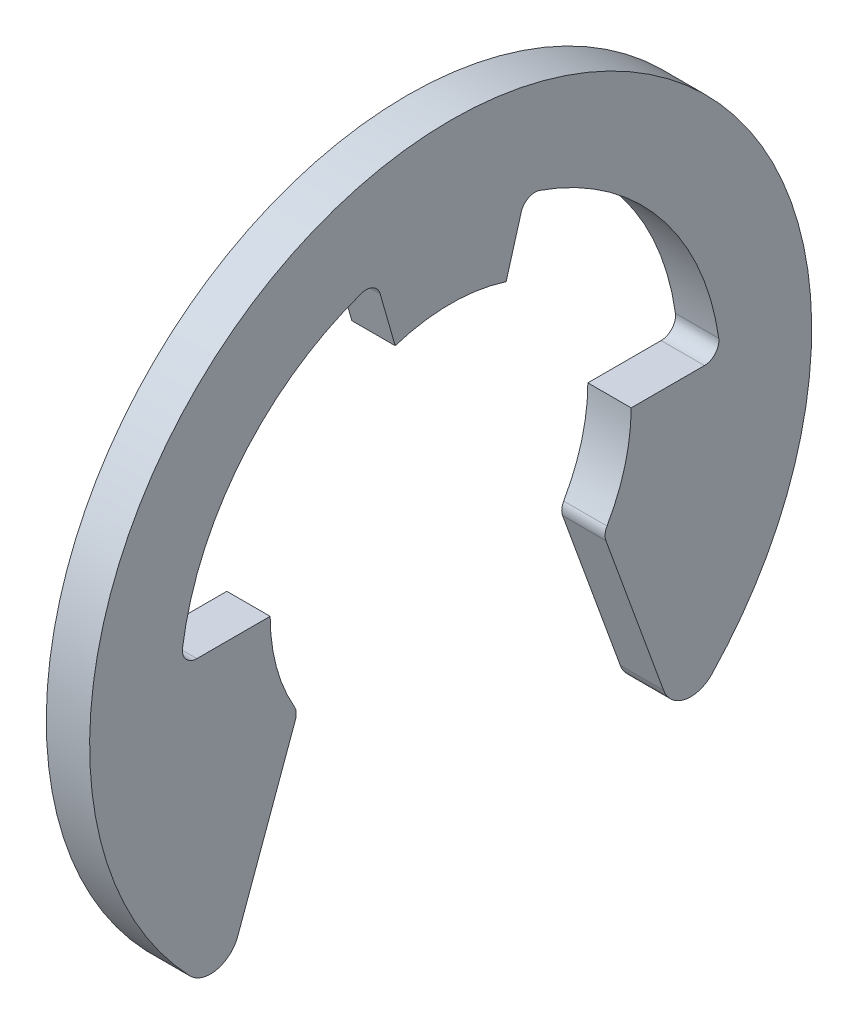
ISO-10303-21;
HEADER;
FILE_DESCRIPTION(('STEP AP214'),'2;1');
FILE_NAME('part.step','',(''),(''),'','','');
FILE_SCHEMA(('AUTOMOTIVE_DESIGN { 1 0 10303 214 1 1 1 1 }'));
ENDSEC;
DATA;
#1=APPLICATION_CONTEXT('core data for automotive mechanical design processes');
#2=APPLICATION_PROTOCOL_DEFINITION('international standard','automotive_design',2000,#1);
#3=PRODUCT_CONTEXT('',#1,'mechanical');
#4=PRODUCT('Part','Part','',(#3));
#5=PRODUCT_RELATED_PRODUCT_CATEGORY('part','',(#4));
#6=PRODUCT_DEFINITION_FORMATION('','',#4);
#7=PRODUCT_DEFINITION_CONTEXT('part definition',#1,'design');
#8=PRODUCT_DEFINITION('design','',#6,#7);
#9=PRODUCT_DEFINITION_SHAPE('','',#8);
#10=(LENGTH_UNIT() NAMED_UNIT(*) SI_UNIT(.MILLI.,.METRE.));
#11=(NAMED_UNIT(*) PLANE_ANGLE_UNIT() SI_UNIT($,.RADIAN.));
#12=(NAMED_UNIT(*) SI_UNIT($,.STERADIAN.) SOLID_ANGLE_UNIT());
#13=UNCERTAINTY_MEASURE_WITH_UNIT(LENGTH_MEASURE(1.E-05),#10,'distance_accuracy_value','');
#14=(GEOMETRIC_REPRESENTATION_CONTEXT(3) GLOBAL_UNCERTAINTY_ASSIGNED_CONTEXT((#13)) GLOBAL_UNIT_ASSIGNED_CONTEXT((#10,
#11,#12)) REPRESENTATION_CONTEXT('',''));
#15=CARTESIAN_POINT('',(0.,0.,0.));
#16=DIRECTION('',(0.,0.,1.));
#17=DIRECTION('',(1.,0.,0.));
#18=AXIS2_PLACEMENT_3D('',#15,#16,#17);
#19=CARTESIAN_POINT('',(1.2,1.,-7.02922470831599));
#20=DIRECTION('',(-1.,0.,0.));
#21=DIRECTION('',(0.,0.,1.));
#22=AXIS2_PLACEMENT_3D('',#19,#20,#21);
#23=CYLINDRICAL_SURFACE('',#22,0.399999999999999);
#24=CARTESIAN_POINT('',(0.,1.,-7.02922470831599));
#25=DIRECTION('',(-1.,0.,0.));
#26=DIRECTION('',(0.,0.,1.));
#27=AXIS2_PLACEMENT_3D('',#24,#25,#26);
#28=CIRCLE('',#27,0.399999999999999);
#29=CARTESIAN_POINT('',(0.,1.05633802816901,-7.42523736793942));
#30=VERTEX_POINT('',#29);
#31=CARTESIAN_POINT('',(0.,0.6,-7.02922470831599));
#32=VERTEX_POINT('',#31);
#33=EDGE_CURVE('E181',#30,#32,#28,.T.);
#34=ORIENTED_EDGE('',*,*,#33,.T.);
#35=DIRECTION('',(-1.,0.,0.));
#36=VECTOR('',#35,1.);
#37=CARTESIAN_POINT('',(1.2,0.6,-7.02922470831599));
#38=LINE('',#37,#36);
#39=CARTESIAN_POINT('',(1.2,0.6,-7.02922470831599));
#40=VERTEX_POINT('',#39);
#41=EDGE_CURVE('E11',#40,#32,#38,.T.);
#42=ORIENTED_EDGE('',*,*,#41,.F.);
#43=CARTESIAN_POINT('',(1.2,1.,-7.02922470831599));
#44=DIRECTION('',(-1.,0.,0.));
#45=DIRECTION('',(0.,0.,1.));
#46=AXIS2_PLACEMENT_3D('',#43,#44,#45);
#47=CIRCLE('',#46,0.399999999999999);
#48=CARTESIAN_POINT('',(1.2,1.05633802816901,-7.42523736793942));
#49=VERTEX_POINT('',#48);
#50=EDGE_CURVE('E240',#49,#40,#47,.T.);
#51=ORIENTED_EDGE('',*,*,#50,.F.);
#52=DIRECTION('',(-1.,0.,0.));
#53=VECTOR('',#52,1.);
#54=CARTESIAN_POINT('',(1.2,1.05633802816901,-7.42523736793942));
#55=LINE('',#54,#53);
#56=EDGE_CURVE('E49',#49,#30,#55,.T.);
#57=ORIENTED_EDGE('',*,*,#56,.T.);
#58=EDGE_LOOP('',(#34,#42,#51,#57));
#59=FACE_BOUND('',#58,.T.);
#60=ADVANCED_FACE('F35',(#59),#23,.F.);
#61=CARTESIAN_POINT('',(1.2,0.6,-5.));
#62=DIRECTION('',(0.,1.,0.));
#63=DIRECTION('',(0.,0.,1.));
#64=AXIS2_PLACEMENT_3D('',#61,#62,#63);
#65=PLANE('',#64);
#66=DIRECTION('',(0.,0.,-1.));
#67=VECTOR('',#66,1.);
#68=CARTESIAN_POINT('',(0.,0.6,-5.));
#69=LINE('',#68,#67);
#70=CARTESIAN_POINT('',(0.,0.600000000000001,-5.));
#71=VERTEX_POINT('',#70);
#72=EDGE_CURVE('E176',#71,#32,#69,.T.);
#73=ORIENTED_EDGE('',*,*,#72,.F.);
#74=DIRECTION('',(-1.,0.,0.));
#75=VECTOR('',#74,1.);
#76=CARTESIAN_POINT('',(1.2,0.600000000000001,-5.));
#77=LINE('',#76,#75);
#78=CARTESIAN_POINT('',(1.2,0.600000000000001,-5.));
#79=VERTEX_POINT('',#78);
#80=EDGE_CURVE('E42',#79,#71,#77,.T.);
#81=ORIENTED_EDGE('',*,*,#80,.F.);
#82=DIRECTION('',(0.,0.,-1.));
#83=VECTOR('',#82,1.);
#84=CARTESIAN_POINT('',(1.2,0.6,-5.));
#85=LINE('',#84,#83);
#86=EDGE_CURVE('E178',#79,#40,#85,.T.);
#87=ORIENTED_EDGE('',*,*,#86,.T.);
#88=ORIENTED_EDGE('',*,*,#41,.T.);
#89=EDGE_LOOP('',(#73,#81,#87,#88));
#90=FACE_BOUND('',#89,.T.);
#91=ADVANCED_FACE('F174',(#90),#65,.T.);
#92=CARTESIAN_POINT('',(1.2,0.6,0.));
#93=DIRECTION('',(-1.,0.,0.));
#94=DIRECTION('',(0.,0.,1.));
#95=AXIS2_PLACEMENT_3D('',#92,#93,#94);
#96=CYLINDRICAL_SURFACE('',#95,5.);
#97=CARTESIAN_POINT('',(0.,0.6,0.));
#98=DIRECTION('',(-1.,0.,0.));
#99=DIRECTION('',(0.,0.,1.));
#100=AXIS2_PLACEMENT_3D('',#97,#98,#99);
#101=CIRCLE('',#100,5.);
#102=CARTESIAN_POINT('',(0.,-1.89993484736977,-4.33016463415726));
#103=VERTEX_POINT('',#102);
#104=EDGE_CURVE('E189',#71,#103,#101,.T.);
#105=ORIENTED_EDGE('',*,*,#104,.T.);
#106=DIRECTION('',(-1.,0.,0.));
#107=VECTOR('',#106,1.);
#108=CARTESIAN_POINT('',(1.2,-1.89993484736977,-4.33016463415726));
#109=LINE('',#108,#107);
#110=CARTESIAN_POINT('',(1.2,-1.89993484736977,-4.33016463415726));
#111=VERTEX_POINT('',#110);
#112=EDGE_CURVE('E320',#111,#103,#109,.T.);
#113=ORIENTED_EDGE('',*,*,#112,.F.);
#114=CARTESIAN_POINT('',(1.2,0.6,0.));
#115=DIRECTION('',(-1.,0.,0.));
#116=DIRECTION('',(0.,0.,1.));
#117=AXIS2_PLACEMENT_3D('',#114,#115,#116);
#118=CIRCLE('',#117,5.);
#119=EDGE_CURVE('E243',#79,#111,#118,.T.);
#120=ORIENTED_EDGE('',*,*,#119,.F.);
#121=ORIENTED_EDGE('',*,*,#80,.T.);
#122=EDGE_LOOP('',(#105,#113,#120,#121));
#123=FACE_BOUND('',#122,.T.);
#124=ADVANCED_FACE('F323',(#123),#96,.F.);
#125=CARTESIAN_POINT('',(1.2,-2.09992963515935,-4.67657780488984));
#126=DIRECTION('',(-1.,0.,0.));
#127=DIRECTION('',(0.,0.,1.));
#128=AXIS2_PLACEMENT_3D('',#125,#126,#127);
#129=CYLINDRICAL_SURFACE('',#128,0.4);
#130=CARTESIAN_POINT('',(0.,-2.09992963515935,-4.67657780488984));
#131=DIRECTION('',(-1.,0.,0.));
#132=DIRECTION('',(0.,0.,1.));
#133=AXIS2_PLACEMENT_3D('',#130,#131,#132);
#134=CIRCLE('',#133,0.4);
#135=CARTESIAN_POINT('',(0.,-2.23673769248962,-4.30070075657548));
#136=VERTEX_POINT('',#135);
#137=EDGE_CURVE('E191',#136,#103,#134,.T.);
#138=ORIENTED_EDGE('',*,*,#137,.F.);
#139=DIRECTION('',(-1.,0.,0.));
#140=VECTOR('',#139,1.);
#141=CARTESIAN_POINT('',(1.2,-2.23673769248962,-4.30070075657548));
#142=LINE('',#141,#140);
#143=CARTESIAN_POINT('',(1.2,-2.23673769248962,-4.30070075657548));
#144=VERTEX_POINT('',#143);
#145=EDGE_CURVE('E318',#144,#136,#142,.T.);
#146=ORIENTED_EDGE('',*,*,#145,.F.);
#147=CARTESIAN_POINT('',(1.2,-2.09992963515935,-4.67657780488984));
#148=DIRECTION('',(-1.,0.,0.));
#149=DIRECTION('',(0.,0.,1.));
#150=AXIS2_PLACEMENT_3D('',#147,#148,#149);
#151=CIRCLE('',#150,0.4);
#152=EDGE_CURVE('E245',#144,#111,#151,.T.);
#153=ORIENTED_EDGE('',*,*,#152,.T.);
#154=ORIENTED_EDGE('',*,*,#112,.T.);
#155=EDGE_LOOP('',(#138,#146,#153,#154));
#156=FACE_BOUND('',#155,.T.);
#157=ADVANCED_FACE('F394',(#156),#129,.T.);
#158=CARTESIAN_POINT('',(1.2,-2.23673769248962,-4.30070075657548));
#159=DIRECTION('',(0.,0.34202014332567,-0.939692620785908));
#160=DIRECTION('',(0.,0.939692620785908,0.34202014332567));
#161=AXIS2_PLACEMENT_3D('',#158,#159,#160);
#162=PLANE('',#161);
#163=DIRECTION('',(0.,-0.939692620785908,-0.34202014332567));
#164=VECTOR('',#163,1.);
#165=CARTESIAN_POINT('',(0.,-2.23673769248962,-4.30070075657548));
#166=LINE('',#165,#164);
#167=CARTESIAN_POINT('',(0.,-6.62967585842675,-5.89959948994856));
#168=VERTEX_POINT('',#167);
#169=EDGE_CURVE('E195',#136,#168,#166,.T.);
#170=ORIENTED_EDGE('',*,*,#169,.T.);
#171=DIRECTION('',(-1.,0.,0.));
#172=VECTOR('',#171,1.);
#173=CARTESIAN_POINT('',(1.2,-6.62967585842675,-5.89959948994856));
#174=LINE('',#173,#172);
#175=CARTESIAN_POINT('',(1.2,-6.62967585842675,-5.89959948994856));
#176=VERTEX_POINT('',#175);
#177=EDGE_CURVE('E316',#176,#168,#174,.T.);
#178=ORIENTED_EDGE('',*,*,#177,.F.);
#179=DIRECTION('',(0.,-0.939692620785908,-0.34202014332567));
#180=VECTOR('',#179,1.);
#181=CARTESIAN_POINT('',(1.2,-2.23673769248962,-4.30070075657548));
#182=LINE('',#181,#180);
#183=EDGE_CURVE('E248',#144,#176,#182,.T.);
#184=ORIENTED_EDGE('',*,*,#183,.F.);
#185=ORIENTED_EDGE('',*,*,#145,.T.);
#186=EDGE_LOOP('',(#170,#178,#184,#185));
#187=FACE_BOUND('',#186,.T.);
#188=ADVANCED_FACE('F391',(#187),#162,.F.);
#189=CARTESIAN_POINT('',(1.2,-6.35605974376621,-6.65135358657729));
#190=DIRECTION('',(-1.,0.,0.));
#191=DIRECTION('',(0.,0.,1.));
#192=AXIS2_PLACEMENT_3D('',#189,#190,#191);
#193=CYLINDRICAL_SURFACE('',#192,0.8);
#194=CARTESIAN_POINT('',(0.,-6.35605974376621,-6.65135358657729));
#195=DIRECTION('',(-1.,0.,0.));
#196=DIRECTION('',(0.,0.,1.));
#197=AXIS2_PLACEMENT_3D('',#194,#195,#196);
#198=CIRCLE('',#197,0.8);
#199=CARTESIAN_POINT('',(0.,-6.90876059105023,-7.22973215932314));
#200=VERTEX_POINT('',#199);
#201=EDGE_CURVE('E198',#200,#168,#198,.T.);
#202=ORIENTED_EDGE('',*,*,#201,.F.);
#203=DIRECTION('',(-1.,0.,0.));
#204=VECTOR('',#203,1.);
#205=CARTESIAN_POINT('',(1.2,-6.90876059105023,-7.22973215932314));
#206=LINE('',#205,#204);
#207=CARTESIAN_POINT('',(1.2,-6.90876059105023,-7.22973215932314));
#208=VERTEX_POINT('',#207);
#209=EDGE_CURVE('E314',#208,#200,#206,.T.);
#210=ORIENTED_EDGE('',*,*,#209,.F.);
#211=CARTESIAN_POINT('',(1.2,-6.35605974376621,-6.65135358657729));
#212=DIRECTION('',(-1.,0.,0.));
#213=DIRECTION('',(0.,0.,1.));
#214=AXIS2_PLACEMENT_3D('',#211,#212,#213);
#215=CIRCLE('',#214,0.8);
#216=EDGE_CURVE('E250',#208,#176,#215,.T.);
#217=ORIENTED_EDGE('',*,*,#216,.T.);
#218=ORIENTED_EDGE('',*,*,#177,.T.);
#219=EDGE_LOOP('',(#202,#210,#217,#218));
#220=FACE_BOUND('',#219,.T.);
#221=ADVANCED_FACE('F385',(#220),#193,.T.);
#222=CARTESIAN_POINT('',(1.2,0.,0.));
#223=DIRECTION('',(-1.,0.,0.));
#224=DIRECTION('',(0.,0.,1.));
#225=AXIS2_PLACEMENT_3D('',#222,#223,#224);
#226=CYLINDRICAL_SURFACE('',#225,10.);
#227=CARTESIAN_POINT('',(0.,0.,0.));
#228=DIRECTION('',(1.,0.,0.));
#229=DIRECTION('',(0.,0.,-1.));
#230=AXIS2_PLACEMENT_3D('',#227,#228,#229);
#231=CIRCLE('',#230,10.);
#232=CARTESIAN_POINT('',(0.,-6.90876059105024,7.22973215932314));
#233=VERTEX_POINT('',#232);
#234=EDGE_CURVE('E201',#200,#233,#231,.T.);
#235=ORIENTED_EDGE('',*,*,#234,.T.);
#236=DIRECTION('',(-1.,0.,0.));
#237=VECTOR('',#236,1.);
#238=CARTESIAN_POINT('',(1.2,-6.90876059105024,7.22973215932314));
#239=LINE('',#238,#237);
#240=CARTESIAN_POINT('',(1.2,-6.90876059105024,7.22973215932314));
#241=VERTEX_POINT('',#240);
#242=EDGE_CURVE('E311',#241,#233,#239,.T.);
#243=ORIENTED_EDGE('',*,*,#242,.F.);
#244=CARTESIAN_POINT('',(1.2,0.,0.));
#245=DIRECTION('',(1.,0.,0.));
#246=DIRECTION('',(0.,0.,-1.));
#247=AXIS2_PLACEMENT_3D('',#244,#245,#246);
#248=CIRCLE('',#247,10.);
#249=EDGE_CURVE('E253',#208,#241,#248,.T.);
#250=ORIENTED_EDGE('',*,*,#249,.F.);
#251=ORIENTED_EDGE('',*,*,#209,.T.);
#252=EDGE_LOOP('',(#235,#243,#250,#251));
#253=FACE_BOUND('',#252,.T.);
#254=ADVANCED_FACE('F395',(#253),#226,.T.);
#255=CARTESIAN_POINT('',(1.2,-6.35605974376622,6.65135358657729));
#256=DIRECTION('',(-1.,0.,0.));
#257=DIRECTION('',(0.,0.,1.));
#258=AXIS2_PLACEMENT_3D('',#255,#256,#257);
#259=CYLINDRICAL_SURFACE('',#258,0.8);
#260=CARTESIAN_POINT('',(0.,-6.35605974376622,6.65135358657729));
#261=DIRECTION('',(1.,0.,0.));
#262=DIRECTION('',(0.,0.,-1.));
#263=AXIS2_PLACEMENT_3D('',#260,#261,#262);
#264=CIRCLE('',#263,0.8);
#265=CARTESIAN_POINT('',(0.,-6.62967585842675,5.89959948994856));
#266=VERTEX_POINT('',#265);
#267=EDGE_CURVE('E203',#233,#266,#264,.T.);
#268=ORIENTED_EDGE('',*,*,#267,.T.);
#269=DIRECTION('',(-1.,0.,0.));
#270=VECTOR('',#269,1.);
#271=CARTESIAN_POINT('',(1.2,-6.62967585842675,5.89959948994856));
#272=LINE('',#271,#270);
#273=CARTESIAN_POINT('',(1.2,-6.62967585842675,5.89959948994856));
#274=VERTEX_POINT('',#273);
#275=EDGE_CURVE('E309',#274,#266,#272,.T.);
#276=ORIENTED_EDGE('',*,*,#275,.F.);
#277=CARTESIAN_POINT('',(1.2,-6.35605974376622,6.65135358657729));
#278=DIRECTION('',(1.,0.,0.));
#279=DIRECTION('',(0.,0.,-1.));
#280=AXIS2_PLACEMENT_3D('',#277,#278,#279);
#281=CIRCLE('',#280,0.8);
#282=EDGE_CURVE('E255',#241,#274,#281,.T.);
#283=ORIENTED_EDGE('',*,*,#282,.F.);
#284=ORIENTED_EDGE('',*,*,#242,.T.);
#285=EDGE_LOOP('',(#268,#276,#283,#284));
#286=FACE_BOUND('',#285,.T.);
#287=ADVANCED_FACE('F378',(#286),#259,.T.);
#288=CARTESIAN_POINT('',(1.2,-2.23673769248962,4.30070075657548));
#289=DIRECTION('',(0.,-0.34202014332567,-0.939692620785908));
#290=DIRECTION('',(0.,0.939692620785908,-0.34202014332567));
#291=AXIS2_PLACEMENT_3D('',#288,#289,#290);
#292=PLANE('',#291);
#293=DIRECTION('',(0.,-0.939692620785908,0.34202014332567));
#294=VECTOR('',#293,1.);
#295=CARTESIAN_POINT('',(0.,-2.23673769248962,4.30070075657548));
#296=LINE('',#295,#294);
#297=CARTESIAN_POINT('',(0.,-2.23673769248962,4.30070075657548));
#298=VERTEX_POINT('',#297);
#299=EDGE_CURVE('E206',#298,#266,#296,.T.);
#300=ORIENTED_EDGE('',*,*,#299,.F.);
#301=DIRECTION('',(-1.,0.,0.));
#302=VECTOR('',#301,1.);
#303=CARTESIAN_POINT('',(1.2,-2.23673769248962,4.30070075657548));
#304=LINE('',#303,#302);
#305=CARTESIAN_POINT('',(1.2,-2.23673769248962,4.30070075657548));
#306=VERTEX_POINT('',#305);
#307=EDGE_CURVE('E307',#306,#298,#304,.T.);
#308=ORIENTED_EDGE('',*,*,#307,.F.);
#309=DIRECTION('',(0.,-0.939692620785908,0.34202014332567));
#310=VECTOR('',#309,1.);
#311=CARTESIAN_POINT('',(1.2,-2.23673769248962,4.30070075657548));
#312=LINE('',#311,#310);
#313=EDGE_CURVE('E257',#306,#274,#312,.T.);
#314=ORIENTED_EDGE('',*,*,#313,.T.);
#315=ORIENTED_EDGE('',*,*,#275,.T.);
#316=EDGE_LOOP('',(#300,#308,#314,#315));
#317=FACE_BOUND('',#316,.T.);
#318=ADVANCED_FACE('F373',(#317),#292,.T.);
#319=CARTESIAN_POINT('',(1.2,-2.09992963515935,4.67657780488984));
#320=DIRECTION('',(-1.,0.,0.));
#321=DIRECTION('',(0.,0.,1.));
#322=AXIS2_PLACEMENT_3D('',#319,#320,#321);
#323=CYLINDRICAL_SURFACE('',#322,0.4);
#324=CARTESIAN_POINT('',(0.,-2.09992963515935,4.67657780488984));
#325=DIRECTION('',(1.,0.,0.));
#326=DIRECTION('',(0.,0.,-1.));
#327=AXIS2_PLACEMENT_3D('',#324,#325,#326);
#328=CIRCLE('',#327,0.4);
#329=CARTESIAN_POINT('',(0.,-1.89993484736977,4.33016463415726));
#330=VERTEX_POINT('',#329);
#331=EDGE_CURVE('E209',#298,#330,#328,.T.);
#332=ORIENTED_EDGE('',*,*,#331,.T.);
#333=DIRECTION('',(-1.,0.,0.));
#334=VECTOR('',#333,1.);
#335=CARTESIAN_POINT('',(1.2,-1.89993484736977,4.33016463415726));
#336=LINE('',#335,#334);
#337=CARTESIAN_POINT('',(1.2,-1.89993484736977,4.33016463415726));
#338=VERTEX_POINT('',#337);
#339=EDGE_CURVE('E305',#338,#330,#336,.T.);
#340=ORIENTED_EDGE('',*,*,#339,.F.);
#341=CARTESIAN_POINT('',(1.2,-2.09992963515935,4.67657780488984));
#342=DIRECTION('',(1.,0.,0.));
#343=DIRECTION('',(0.,0.,-1.));
#344=AXIS2_PLACEMENT_3D('',#341,#342,#343);
#345=CIRCLE('',#344,0.4);
#346=EDGE_CURVE('E260',#306,#338,#345,.T.);
#347=ORIENTED_EDGE('',*,*,#346,.F.);
#348=ORIENTED_EDGE('',*,*,#307,.T.);
#349=EDGE_LOOP('',(#332,#340,#347,#348));
#350=FACE_BOUND('',#349,.T.);
#351=ADVANCED_FACE('F369',(#350),#323,.T.);
#352=CARTESIAN_POINT('',(1.2,0.6,0.));
#353=DIRECTION('',(-1.,0.,0.));
#354=DIRECTION('',(0.,0.,1.));
#355=AXIS2_PLACEMENT_3D('',#352,#353,#354);
#356=CYLINDRICAL_SURFACE('',#355,5.);
#357=CARTESIAN_POINT('',(0.,0.6,0.));
#358=DIRECTION('',(1.,0.,0.));
#359=DIRECTION('',(0.,0.,-1.));
#360=AXIS2_PLACEMENT_3D('',#357,#358,#359);
#361=CIRCLE('',#360,5.);
#362=CARTESIAN_POINT('',(0.,0.599999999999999,5.));
#363=VERTEX_POINT('',#362);
#364=EDGE_CURVE('E212',#363,#330,#361,.T.);
#365=ORIENTED_EDGE('',*,*,#364,.F.);
#366=DIRECTION('',(-1.,0.,0.));
#367=VECTOR('',#366,1.);
#368=CARTESIAN_POINT('',(1.2,0.599999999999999,5.));
#369=LINE('',#368,#367);
#370=CARTESIAN_POINT('',(1.2,0.599999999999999,5.));
#371=VERTEX_POINT('',#370);
#372=EDGE_CURVE('E303',#371,#363,#369,.T.);
#373=ORIENTED_EDGE('',*,*,#372,.F.);
#374=CARTESIAN_POINT('',(1.2,0.6,0.));
#375=DIRECTION('',(1.,0.,0.));
#376=DIRECTION('',(0.,0.,-1.));
#377=AXIS2_PLACEMENT_3D('',#374,#375,#376);
#378=CIRCLE('',#377,5.);
#379=EDGE_CURVE('E262',#371,#338,#378,.T.);
#380=ORIENTED_EDGE('',*,*,#379,.T.);
#381=ORIENTED_EDGE('',*,*,#339,.T.);
#382=EDGE_LOOP('',(#365,#373,#380,#381));
#383=FACE_BOUND('',#382,.T.);
#384=ADVANCED_FACE('F363',(#383),#356,.F.);
#385=CARTESIAN_POINT('',(1.2,0.599999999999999,5.));
#386=DIRECTION('',(0.,-1.,0.));
#387=DIRECTION('',(0.,0.,-1.));
#388=AXIS2_PLACEMENT_3D('',#385,#386,#387);
#389=PLANE('',#388);
#390=DIRECTION('',(0.,0.,1.));
#391=VECTOR('',#390,1.);
#392=CARTESIAN_POINT('',(0.,0.599999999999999,5.));
#393=LINE('',#392,#391);
#394=CARTESIAN_POINT('',(0.,0.599999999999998,7.02922470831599));
#395=VERTEX_POINT('',#394);
#396=EDGE_CURVE('E215',#363,#395,#393,.T.);
#397=ORIENTED_EDGE('',*,*,#396,.T.);
#398=DIRECTION('',(-1.,0.,0.));
#399=VECTOR('',#398,1.);
#400=CARTESIAN_POINT('',(1.2,0.599999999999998,7.02922470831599));
#401=LINE('',#400,#399);
#402=CARTESIAN_POINT('',(1.2,0.599999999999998,7.02922470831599));
#403=VERTEX_POINT('',#402);
#404=EDGE_CURVE('E301',#403,#395,#401,.T.);
#405=ORIENTED_EDGE('',*,*,#404,.F.);
#406=DIRECTION('',(0.,0.,1.));
#407=VECTOR('',#406,1.);
#408=CARTESIAN_POINT('',(1.2,0.599999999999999,5.));
#409=LINE('',#408,#407);
#410=EDGE_CURVE('E265',#371,#403,#409,.T.);
#411=ORIENTED_EDGE('',*,*,#410,.F.);
#412=ORIENTED_EDGE('',*,*,#372,.T.);
#413=EDGE_LOOP('',(#397,#405,#411,#412));
#414=FACE_BOUND('',#413,.T.);
#415=ADVANCED_FACE('F459',(#414),#389,.F.);
#416=CARTESIAN_POINT('',(1.2,0.999999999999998,7.02922470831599));
#417=DIRECTION('',(-1.,0.,0.));
#418=DIRECTION('',(0.,0.,1.));
#419=AXIS2_PLACEMENT_3D('',#416,#417,#418);
#420=CYLINDRICAL_SURFACE('',#419,0.399999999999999);
#421=CARTESIAN_POINT('',(0.,0.999999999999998,7.02922470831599));
#422=DIRECTION('',(1.,0.,0.));
#423=DIRECTION('',(0.,0.,-1.));
#424=AXIS2_PLACEMENT_3D('',#421,#422,#423);
#425=CIRCLE('',#424,0.399999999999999);
#426=CARTESIAN_POINT('',(0.,1.05633802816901,7.42523736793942));
#427=VERTEX_POINT('',#426);
#428=EDGE_CURVE('E218',#427,#395,#425,.T.);
#429=ORIENTED_EDGE('',*,*,#428,.F.);
#430=DIRECTION('',(-1.,0.,0.));
#431=VECTOR('',#430,1.);
#432=CARTESIAN_POINT('',(1.2,1.05633802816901,7.42523736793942));
#433=LINE('',#432,#431);
#434=CARTESIAN_POINT('',(1.2,1.05633802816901,7.42523736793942));
#435=VERTEX_POINT('',#434);
#436=EDGE_CURVE('E299',#435,#427,#433,.T.);
#437=ORIENTED_EDGE('',*,*,#436,.F.);
#438=CARTESIAN_POINT('',(1.2,0.999999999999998,7.02922470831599));
#439=DIRECTION('',(1.,0.,0.));
#440=DIRECTION('',(0.,0.,-1.));
#441=AXIS2_PLACEMENT_3D('',#438,#439,#440);
#442=CIRCLE('',#441,0.399999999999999);
#443=EDGE_CURVE('E267',#435,#403,#442,.T.);
#444=ORIENTED_EDGE('',*,*,#443,.T.);
#445=ORIENTED_EDGE('',*,*,#404,.T.);
#446=EDGE_LOOP('',(#429,#437,#444,#445));
#447=FACE_BOUND('',#446,.T.);
#448=ADVANCED_FACE('F356',(#447),#420,.F.);
#449=CARTESIAN_POINT('',(1.2,0.,0.));
#450=DIRECTION('',(-1.,0.,0.));
#451=DIRECTION('',(0.,0.,1.));
#452=AXIS2_PLACEMENT_3D('',#449,#450,#451);
#453=CYLINDRICAL_SURFACE('',#452,7.5);
#454=CARTESIAN_POINT('',(0.,0.,0.));
#455=DIRECTION('',(-1.,0.,0.));
#456=DIRECTION('',(0.,0.,1.));
#457=AXIS2_PLACEMENT_3D('',#454,#455,#456);
#458=CIRCLE('',#457,7.5);
#459=CARTESIAN_POINT('',(0.,7.08154581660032,2.47016372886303));
#460=VERTEX_POINT('',#459);
#461=EDGE_CURVE('E221',#427,#460,#458,.T.);
#462=ORIENTED_EDGE('',*,*,#461,.T.);
#463=DIRECTION('',(-1.,0.,0.));
#464=VECTOR('',#463,1.);
#465=CARTESIAN_POINT('',(1.2,7.08154581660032,2.47016372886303));
#466=LINE('',#465,#464);
#467=CARTESIAN_POINT('',(1.2,7.08154581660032,2.47016372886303));
#468=VERTEX_POINT('',#467);
#469=EDGE_CURVE('E296',#468,#460,#466,.T.);
#470=ORIENTED_EDGE('',*,*,#469,.F.);
#471=CARTESIAN_POINT('',(1.2,0.,0.));
#472=DIRECTION('',(-1.,0.,0.));
#473=DIRECTION('',(0.,0.,1.));
#474=AXIS2_PLACEMENT_3D('',#471,#472,#473);
#475=CIRCLE('',#474,7.5);
#476=EDGE_CURVE('E270',#435,#468,#475,.T.);
#477=ORIENTED_EDGE('',*,*,#476,.F.);
#478=ORIENTED_EDGE('',*,*,#436,.T.);
#479=EDGE_LOOP('',(#462,#470,#477,#478));
#480=FACE_BOUND('',#479,.T.);
#481=ADVANCED_FACE('F353',(#480),#453,.F.);
#482=CARTESIAN_POINT('',(1.2,6.7038633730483,2.33842166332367));
#483=DIRECTION('',(-1.,0.,0.));
#484=DIRECTION('',(0.,0.,1.));
#485=AXIS2_PLACEMENT_3D('',#482,#483,#484);
#486=CYLINDRICAL_SURFACE('',#485,0.4);
#487=CARTESIAN_POINT('',(0.,6.7038633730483,2.33842166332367));
#488=DIRECTION('',(-1.,0.,0.));
#489=DIRECTION('',(0.,0.,1.));
#490=AXIS2_PLACEMENT_3D('',#487,#488,#489);
#491=CIRCLE('',#490,0.4);
#492=CARTESIAN_POINT('',(0.,6.8141183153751,1.95391698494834));
#493=VERTEX_POINT('',#492);
#494=EDGE_CURVE('E223',#460,#493,#491,.T.);
#495=ORIENTED_EDGE('',*,*,#494,.T.);
#496=DIRECTION('',(-1.,0.,0.));
#497=VECTOR('',#496,1.);
#498=CARTESIAN_POINT('',(1.2,6.8141183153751,1.95391698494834));
#499=LINE('',#498,#497);
#500=CARTESIAN_POINT('',(1.2,6.8141183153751,1.95391698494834));
#501=VERTEX_POINT('',#500);
#502=EDGE_CURVE('E294',#501,#493,#499,.T.);
#503=ORIENTED_EDGE('',*,*,#502,.F.);
#504=CARTESIAN_POINT('',(1.2,6.7038633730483,2.33842166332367));
#505=DIRECTION('',(-1.,0.,0.));
#506=DIRECTION('',(0.,0.,1.));
#507=AXIS2_PLACEMENT_3D('',#504,#505,#506);
#508=CIRCLE('',#507,0.4);
#509=EDGE_CURVE('E272',#468,#501,#508,.T.);
#510=ORIENTED_EDGE('',*,*,#509,.F.);
#511=ORIENTED_EDGE('',*,*,#469,.T.);
#512=EDGE_LOOP('',(#495,#503,#510,#511));
#513=FACE_BOUND('',#512,.T.);
#514=ADVANCED_FACE('F348',(#513),#486,.F.);
#515=CARTESIAN_POINT('',(1.2,5.35809300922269,1.53640844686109));
#516=DIRECTION('',(0.,-0.275637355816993,0.961261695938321));
#517=DIRECTION('',(0.,-0.961261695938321,-0.275637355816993));
#518=AXIS2_PLACEMENT_3D('',#515,#516,#517);
#519=PLANE('',#518);
#520=DIRECTION('',(0.,0.961261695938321,0.275637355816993));
#521=VECTOR('',#520,1.);
#522=CARTESIAN_POINT('',(0.,5.35809300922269,1.53640844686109));
#523=LINE('',#522,#521);
#524=CARTESIAN_POINT('',(0.,5.35809300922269,1.53640844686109));
#525=VERTEX_POINT('',#524);
#526=EDGE_CURVE('E226',#525,#493,#523,.T.);
#527=ORIENTED_EDGE('',*,*,#526,.F.);
#528=DIRECTION('',(-1.,0.,0.));
#529=VECTOR('',#528,1.);
#530=CARTESIAN_POINT('',(1.2,5.35809300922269,1.53640844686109));
#531=LINE('',#530,#529);
#532=CARTESIAN_POINT('',(1.2,5.35809300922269,1.53640844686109));
#533=VERTEX_POINT('',#532);
#534=EDGE_CURVE('E292',#533,#525,#531,.T.);
#535=ORIENTED_EDGE('',*,*,#534,.F.);
#536=DIRECTION('',(0.,0.961261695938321,0.275637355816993));
#537=VECTOR('',#536,1.);
#538=CARTESIAN_POINT('',(1.2,5.35809300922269,1.53640844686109));
#539=LINE('',#538,#537);
#540=EDGE_CURVE('E274',#533,#501,#539,.T.);
#541=ORIENTED_EDGE('',*,*,#540,.T.);
#542=ORIENTED_EDGE('',*,*,#502,.T.);
#543=EDGE_LOOP('',(#527,#535,#541,#542));
#544=FACE_BOUND('',#543,.T.);
#545=ADVANCED_FACE('F342',(#544),#519,.T.);
#546=CARTESIAN_POINT('',(1.2,0.6,0.));
#547=DIRECTION('',(-1.,0.,0.));
#548=DIRECTION('',(0.,0.,1.));
#549=AXIS2_PLACEMENT_3D('',#546,#547,#548);
#550=CYLINDRICAL_SURFACE('',#549,5.);
#551=CARTESIAN_POINT('',(0.,0.6,0.));
#552=DIRECTION('',(1.,0.,0.));
#553=DIRECTION('',(0.,0.,-1.));
#554=AXIS2_PLACEMENT_3D('',#551,#552,#553);
#555=CIRCLE('',#554,5.);
#556=CARTESIAN_POINT('',(0.,5.35809300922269,-1.53640844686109));
#557=VERTEX_POINT('',#556);
#558=EDGE_CURVE('E229',#557,#525,#555,.T.);
#559=ORIENTED_EDGE('',*,*,#558,.F.);
#560=DIRECTION('',(-1.,0.,0.));
#561=VECTOR('',#560,1.);
#562=CARTESIAN_POINT('',(1.2,5.35809300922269,-1.53640844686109));
#563=LINE('',#562,#561);
#564=CARTESIAN_POINT('',(1.2,5.35809300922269,-1.53640844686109));
#565=VERTEX_POINT('',#564);
#566=EDGE_CURVE('E290',#565,#557,#563,.T.);
#567=ORIENTED_EDGE('',*,*,#566,.F.);
#568=CARTESIAN_POINT('',(1.2,0.6,0.));
#569=DIRECTION('',(1.,0.,0.));
#570=DIRECTION('',(0.,0.,-1.));
#571=AXIS2_PLACEMENT_3D('',#568,#569,#570);
#572=CIRCLE('',#571,5.);
#573=EDGE_CURVE('E277',#565,#533,#572,.T.);
#574=ORIENTED_EDGE('',*,*,#573,.T.);
#575=ORIENTED_EDGE('',*,*,#534,.T.);
#576=EDGE_LOOP('',(#559,#567,#574,#575));
#577=FACE_BOUND('',#576,.T.);
#578=ADVANCED_FACE('F336',(#577),#550,.F.);
#579=CARTESIAN_POINT('',(1.2,5.35809300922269,-1.53640844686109));
#580=DIRECTION('',(0.,0.275637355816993,0.961261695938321));
#581=DIRECTION('',(0.,-0.961261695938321,0.275637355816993));
#582=AXIS2_PLACEMENT_3D('',#579,#580,#581);
#583=PLANE('',#582);
#584=DIRECTION('',(0.,0.961261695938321,-0.275637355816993));
#585=VECTOR('',#584,1.);
#586=CARTESIAN_POINT('',(0.,5.35809300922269,-1.53640844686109));
#587=LINE('',#586,#585);
#588=CARTESIAN_POINT('',(0.,6.8141183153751,-1.95391698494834));
#589=VERTEX_POINT('',#588);
#590=EDGE_CURVE('E232',#557,#589,#587,.T.);
#591=ORIENTED_EDGE('',*,*,#590,.T.);
#592=DIRECTION('',(-1.,0.,0.));
#593=VECTOR('',#592,1.);
#594=CARTESIAN_POINT('',(1.2,6.8141183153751,-1.95391698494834));
#595=LINE('',#594,#593);
#596=CARTESIAN_POINT('',(1.2,6.8141183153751,-1.95391698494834));
#597=VERTEX_POINT('',#596);
#598=EDGE_CURVE('E288',#597,#589,#595,.T.);
#599=ORIENTED_EDGE('',*,*,#598,.F.);
#600=DIRECTION('',(0.,0.961261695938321,-0.275637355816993));
#601=VECTOR('',#600,1.);
#602=CARTESIAN_POINT('',(1.2,5.35809300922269,-1.53640844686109));
#603=LINE('',#602,#601);
#604=EDGE_CURVE('E280',#565,#597,#603,.T.);
#605=ORIENTED_EDGE('',*,*,#604,.F.);
#606=ORIENTED_EDGE('',*,*,#566,.T.);
#607=EDGE_LOOP('',(#591,#599,#605,#606));
#608=FACE_BOUND('',#607,.T.);
#609=ADVANCED_FACE('F508',(#608),#583,.F.);
#610=CARTESIAN_POINT('',(1.2,6.7038633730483,-2.33842166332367));
#611=DIRECTION('',(-1.,0.,0.));
#612=DIRECTION('',(0.,0.,1.));
#613=AXIS2_PLACEMENT_3D('',#610,#611,#612);
#614=CYLINDRICAL_SURFACE('',#613,0.4);
#615=CARTESIAN_POINT('',(0.,6.7038633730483,-2.33842166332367));
#616=DIRECTION('',(1.,0.,0.));
#617=DIRECTION('',(0.,0.,-1.));
#618=AXIS2_PLACEMENT_3D('',#615,#616,#617);
#619=CIRCLE('',#618,0.4);
#620=CARTESIAN_POINT('',(0.,7.08154581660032,-2.47016372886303));
#621=VERTEX_POINT('',#620);
#622=EDGE_CURVE('E235',#621,#589,#619,.T.);
#623=ORIENTED_EDGE('',*,*,#622,.F.);
#624=DIRECTION('',(-1.,0.,0.));
#625=VECTOR('',#624,1.);
#626=CARTESIAN_POINT('',(1.2,7.08154581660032,-2.47016372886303));
#627=LINE('',#626,#625);
#628=CARTESIAN_POINT('',(1.2,7.08154581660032,-2.47016372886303));
#629=VERTEX_POINT('',#628);
#630=EDGE_CURVE('E57',#629,#621,#627,.T.);
#631=ORIENTED_EDGE('',*,*,#630,.F.);
#632=CARTESIAN_POINT('',(1.2,6.7038633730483,-2.33842166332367));
#633=DIRECTION('',(1.,0.,0.));
#634=DIRECTION('',(0.,0.,-1.));
#635=AXIS2_PLACEMENT_3D('',#632,#633,#634);
#636=CIRCLE('',#635,0.4);
#637=EDGE_CURVE('E282',#629,#597,#636,.T.);
#638=ORIENTED_EDGE('',*,*,#637,.T.);
#639=ORIENTED_EDGE('',*,*,#598,.T.);
#640=EDGE_LOOP('',(#623,#631,#638,#639));
#641=FACE_BOUND('',#640,.T.);
#642=ADVANCED_FACE('F330',(#641),#614,.F.);
#643=CARTESIAN_POINT('',(1.2,0.,0.));
#644=DIRECTION('',(-1.,0.,0.));
#645=DIRECTION('',(0.,0.,1.));
#646=AXIS2_PLACEMENT_3D('',#643,#644,#645);
#647=CYLINDRICAL_SURFACE('',#646,7.5);
#648=CARTESIAN_POINT('',(0.,0.,0.));
#649=DIRECTION('',(1.,0.,0.));
#650=DIRECTION('',(0.,0.,-1.));
#651=AXIS2_PLACEMENT_3D('',#648,#649,#650);
#652=CIRCLE('',#651,7.5);
#653=EDGE_CURVE('E238',#30,#621,#652,.T.);
#654=ORIENTED_EDGE('',*,*,#653,.F.);
#655=ORIENTED_EDGE('',*,*,#56,.F.);
#656=CARTESIAN_POINT('',(1.2,0.,0.));
#657=DIRECTION('',(1.,0.,0.));
#658=DIRECTION('',(0.,0.,-1.));
#659=AXIS2_PLACEMENT_3D('',#656,#657,#658);
#660=CIRCLE('',#659,7.5);
#661=EDGE_CURVE('E284',#49,#629,#660,.T.);
#662=ORIENTED_EDGE('',*,*,#661,.T.);
#663=ORIENTED_EDGE('',*,*,#630,.T.);
#664=EDGE_LOOP('',(#654,#655,#662,#663));
#665=FACE_BOUND('',#664,.T.);
#666=ADVANCED_FACE('F329',(#665),#647,.F.);
#667=CARTESIAN_POINT('',(1.2,1.,-7.02922470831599));
#668=DIRECTION('',(-1.,0.,0.));
#669=DIRECTION('',(0.,0.,1.));
#670=AXIS2_PLACEMENT_3D('',#667,#668,#669);
#671=PLANE('',#670);
#672=ORIENTED_EDGE('',*,*,#50,.T.);
#673=ORIENTED_EDGE('',*,*,#86,.F.);
#674=ORIENTED_EDGE('',*,*,#119,.T.);
#675=ORIENTED_EDGE('',*,*,#152,.F.);
#676=ORIENTED_EDGE('',*,*,#183,.T.);
#677=ORIENTED_EDGE('',*,*,#216,.F.);
#678=ORIENTED_EDGE('',*,*,#249,.T.);
#679=ORIENTED_EDGE('',*,*,#282,.T.);
#680=ORIENTED_EDGE('',*,*,#313,.F.);
#681=ORIENTED_EDGE('',*,*,#346,.T.);
#682=ORIENTED_EDGE('',*,*,#379,.F.);
#683=ORIENTED_EDGE('',*,*,#410,.T.);
#684=ORIENTED_EDGE('',*,*,#443,.F.);
#685=ORIENTED_EDGE('',*,*,#476,.T.);
#686=ORIENTED_EDGE('',*,*,#509,.T.);
#687=ORIENTED_EDGE('',*,*,#540,.F.);
#688=ORIENTED_EDGE('',*,*,#573,.F.);
#689=ORIENTED_EDGE('',*,*,#604,.T.);
#690=ORIENTED_EDGE('',*,*,#637,.F.);
#691=ORIENTED_EDGE('',*,*,#661,.F.);
#692=EDGE_LOOP('',(#672,#673,#674,#675,#676,#677,#678,#679,#680,#681,#682,#683,#684,#685,#686,
#687,#688,#689,#690,#691));
#693=FACE_BOUND('',#692,.T.);
#694=ADVANCED_FACE('F327',(#693),#671,.F.);
#695=CARTESIAN_POINT('',(0.,1.,-7.02922470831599));
#696=DIRECTION('',(-1.,0.,0.));
#697=DIRECTION('',(0.,0.,1.));
#698=AXIS2_PLACEMENT_3D('',#695,#696,#697);
#699=PLANE('',#698);
#700=ORIENTED_EDGE('',*,*,#33,.F.);
#701=ORIENTED_EDGE('',*,*,#653,.T.);
#702=ORIENTED_EDGE('',*,*,#622,.T.);
#703=ORIENTED_EDGE('',*,*,#590,.F.);
#704=ORIENTED_EDGE('',*,*,#558,.T.);
#705=ORIENTED_EDGE('',*,*,#526,.T.);
#706=ORIENTED_EDGE('',*,*,#494,.F.);
#707=ORIENTED_EDGE('',*,*,#461,.F.);
#708=ORIENTED_EDGE('',*,*,#428,.T.);
#709=ORIENTED_EDGE('',*,*,#396,.F.);
#710=ORIENTED_EDGE('',*,*,#364,.T.);
#711=ORIENTED_EDGE('',*,*,#331,.F.);
#712=ORIENTED_EDGE('',*,*,#299,.T.);
#713=ORIENTED_EDGE('',*,*,#267,.F.);
#714=ORIENTED_EDGE('',*,*,#234,.F.);
#715=ORIENTED_EDGE('',*,*,#201,.T.);
#716=ORIENTED_EDGE('',*,*,#169,.F.);
#717=ORIENTED_EDGE('',*,*,#137,.T.);
#718=ORIENTED_EDGE('',*,*,#104,.F.);
#719=ORIENTED_EDGE('',*,*,#72,.T.);
#720=EDGE_LOOP('',(#700,#701,#702,#703,#704,#705,#706,#707,#708,#709,#710,#711,#712,#713,#714,
#715,#716,#717,#718,#719));
#721=FACE_BOUND('',#720,.T.);
#722=ADVANCED_FACE('F186',(#721),#699,.T.);
#723=CLOSED_SHELL('',(#60,#91,#124,#157,#188,#221,#254,#287,#318,#351,#384,#415,#448,#481,#514,
#545,#578,#609,#642,#666,#694,#722));
#724=MANIFOLD_SOLID_BREP('B2',#723);
#725=ADVANCED_BREP_SHAPE_REPRESENTATION('',(#18,#724),#14);
#726=SHAPE_DEFINITION_REPRESENTATION(#9,#725);
ENDSEC;
END-ISO-10303-21;
